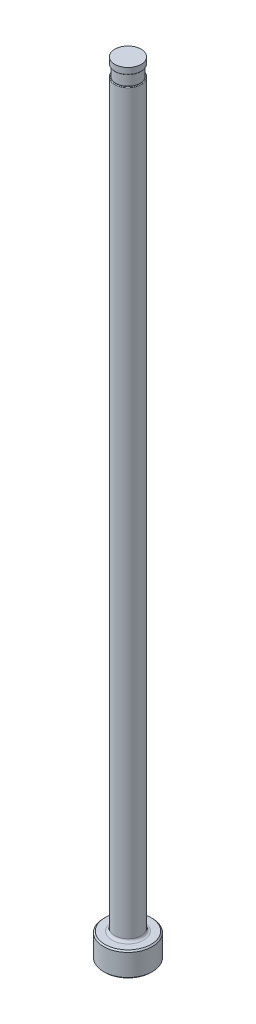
from build123d import *

# Parameters (mm, degrees)
CHAMFER1_SIZE     = 0.254
FILLET1_R         = 0.508
SKETCH2_W         = 0.2032
SKETCH2_H         = 2.032
D_SLOT_DEPTH      = 153.548755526
D_SLOT_DEPTH_BACK = 153.548755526
SKETCH5_W         = 0.0127
SKETCH5_H         = 1.27
FILLET2_R         = 0.127


with BuildPart() as part:
    # Sketch1 → Revolve1 (revolve)
    with BuildSketch(Plane.XY, mode=Mode.PRIVATE) as revolve1_sk:
        Polygon((0, 0), (-4.7625, 0), (-4.7625, 4.7498), (-2.57937, 4.7498), (-2.57937, 152.4), (0, 152.4), align=None)
    revolve(revolve1_sk.sketch.rotate(Axis((0, 259.958771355, 0), (0, -1, 0)), 270), axis=Axis((0, 259.958771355, 0), (0, -1, 0)))

    # Chamfer1
    chamfer1_edges = [part.edges().sort_by_distance(p)[0] for p in [
        (0, 4.7498, -4.7625),
        (0, 0, -4.7625),
    ]]
    chamfer(chamfer1_edges, length=CHAMFER1_SIZE)

    # Fillet1
    fillet1_edges = [part.edges().sort_by_distance(p)[0] for p in [
        (0, 4.7498, -2.57937),
    ]]
    fillet(fillet1_edges, radius=FILLET1_R)

    # Sketch2 → Vent Relief (revolve, cut)
    with BuildSketch(Plane.XY, mode=Mode.PRIVATE) as vent_relief_sk:
        with Locations((-2.47777, 150.114)):
            Rectangle(SKETCH2_W, SKETCH2_H)
    revolve(vent_relief_sk.sketch.rotate(Axis((0, 153.448281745, 0), (0, -1, 0)), 270), axis=Axis((0, 153.448281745, 0), (0, -1, 0)), mode=Mode.SUBTRACT)

    # Sketch3 → D-Slot (cut, two sides: drawn at the far end of the back side and taken through both)
    with BuildSketch(Plane.XY.offset(-D_SLOT_DEPTH_BACK)):
        with BuildLine():
            Line((-2.37617, 150.114), (-2.37617, 86.614))
            ThreePointArc((-2.37617, 86.614), (-2.427383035, 86.046038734), (-2.57937, 85.4964))
            Line((-2.57937, 85.4964), (-2.57937, 150.114))
            Line((-2.57937, 150.114), (-2.37617, 150.114))
        make_face()
    extrude(amount=D_SLOT_DEPTH + D_SLOT_DEPTH_BACK, mode=Mode.SUBTRACT)

    # Sketch5 → Vent Diameter (revolve, cut)
    with BuildSketch(Plane.XY, mode=Mode.PRIVATE) as vent_diameter_sk:
        with Locations((-2.57302, 151.765)):
            Rectangle(SKETCH5_W, SKETCH5_H)
    revolve(vent_diameter_sk.sketch.rotate(Axis((0, 152.687735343, 0), (0, -1, 0)), 90), axis=Axis((0, 152.687735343, 0), (0, -1, 0)), mode=Mode.SUBTRACT)

    # Fillet2
    fillet2_edges = [part.edges().sort_by_distance(p)[0] for p in [
        (2.149591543, 149.098, -1.425624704),
        (0, 151.13, 2.56667),
    ]]
    fillet(fillet2_edges, radius=FILLET2_R)


solid = part.part
